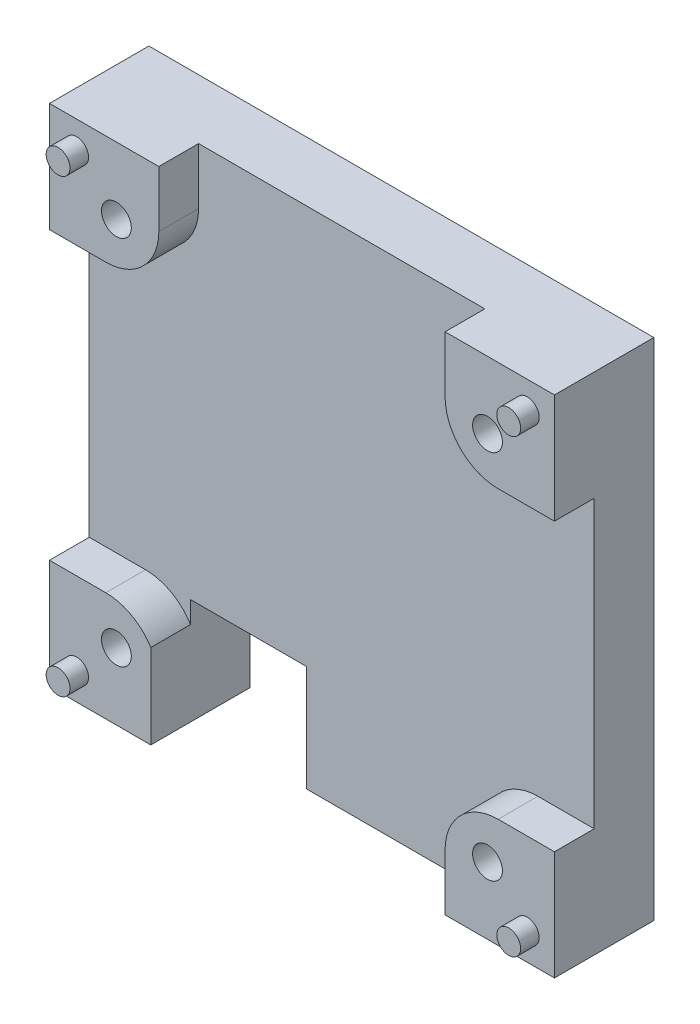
from build123d import *

# Parameters (mm, degrees)
SKETCH3_W           = 38.1
SKETCH3_H           = 38.1
SKETCH3_R           = 1.125
BOSS_EXTRUDE1_DEPTH = 4.5
BOSS_EXTRUDE2_START = 3
SKETCH2_R           = 1.125
BOSS_EXTRUDE2_DEPTH = 3
SKETCH4_W           = 8.75
SKETCH4_H           = 5.25
CUT_EXTRUDE1_DEPTH  = 10
SKETCH6_W           = 8.75
SKETCH6_H           = 2.75
CUT_EXTRUDE2_DEPTH  = 10
SKETCH7_R           = 0.9
BOSS_EXTRUDE3_DEPTH = 1.4


with BuildPart() as part:
    # Sketch3 → Boss-Extrude1 (new body)
    with BuildSketch(Plane.XY):
        with Locations((0.466348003, 11.564505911)):
            Rectangle(SKETCH3_W, SKETCH3_H)
        with Locations((-13.533651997, 25.564505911)):
            Circle(SKETCH3_R, mode=Mode.SUBTRACT)
        with Locations((14.466348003, 25.564505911)):
            Circle(SKETCH3_R, mode=Mode.SUBTRACT)
        with Locations((14.466348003, -2.435494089)):
            Circle(SKETCH3_R, mode=Mode.SUBTRACT)
        with Locations((-13.533651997, -2.435494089)):
            Circle(SKETCH3_R, mode=Mode.SUBTRACT)
    extrude(amount=-BOSS_EXTRUDE1_DEPTH)

    # Sketch2 → Boss-Extrude2 (add)
    # profile 1 of 4: a face of its own
    with BuildSketch(Plane.XY.offset(BOSS_EXTRUDE2_START)):
        with BuildLine():
            Line((-18.583651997, 30.614505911), (-10.333651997, 30.614505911))
            Line((-10.333651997, 30.614505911), (-10.333651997, 26.364505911))
            ThreePointArc((-10.333651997, 26.364505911), (-11.505224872, 23.536078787), (-14.333651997, 22.364505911))
            Line((-14.333651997, 22.364505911), (-18.583651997, 22.364505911))
            Line((-18.583651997, 22.364505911), (-18.583651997, 30.614505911))
        make_face()
        with Locations((-13.533651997, 25.564505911)):
            Circle(SKETCH2_R, mode=Mode.SUBTRACT)
    # profile 2 of 4: a face of its own
    with BuildSketch(Plane.XY.offset(BOSS_EXTRUDE2_START)):
        with BuildLine():
            Line((19.516348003, 30.614505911), (11.266348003, 30.614505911))
            Line((11.266348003, 30.614505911), (11.266348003, 26.364505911))
            ThreePointArc((11.266348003, 26.364505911), (12.437920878, 23.536078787), (15.266348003, 22.364505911))
            Line((15.266348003, 22.364505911), (19.516348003, 22.364505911))
            Line((19.516348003, 22.364505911), (19.516348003, 30.614505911))
        make_face()
        with Locations((14.466348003, 25.564505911)):
            Circle(SKETCH2_R, mode=Mode.SUBTRACT)
    # profile 3 of 4: a face of its own
    with BuildSketch(Plane.XY.offset(BOSS_EXTRUDE2_START)):
        with BuildLine():
            Line((19.516348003, -7.485494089), (11.266348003, -7.485494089))
            Line((11.266348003, -7.485494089), (11.266348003, -3.235494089))
            ThreePointArc((11.266348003, -3.235494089), (12.437920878, -0.407066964), (15.266348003, 0.764505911))
            Line((15.266348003, 0.764505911), (19.516348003, 0.764505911))
            Line((19.516348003, 0.764505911), (19.516348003, -7.485494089))
        make_face()
        with Locations((14.466348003, -2.435494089)):
            Circle(SKETCH2_R, mode=Mode.SUBTRACT)
    # profile 4 of 4: a face of its own
    with BuildSketch(Plane.XY.offset(BOSS_EXTRUDE2_START)):
        with BuildLine():
            Line((-18.583651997, -7.485494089), (-10.333651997, -7.485494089))
            Line((-10.333651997, -7.485494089), (-10.333651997, -3.235494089))
            ThreePointArc((-10.333651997, -3.235494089), (-11.505224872, -0.407066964), (-14.333651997, 0.764505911))
            Line((-14.333651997, 0.764505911), (-18.583651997, 0.764505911))
            Line((-18.583651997, 0.764505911), (-18.583651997, -7.485494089))
        make_face()
        with Locations((-13.533651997, -2.435494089)):
            Circle(SKETCH2_R, mode=Mode.SUBTRACT)
    extrude(amount=-BOSS_EXTRUDE2_DEPTH)

    # Sketch4 → Cut-Extrude1 (cut)
    with BuildSketch(Plane(origin=(0, 0, -4.5), x_dir=(-1, 0, 0), z_dir=(0, 0, -1))):
        with Locations((6.563651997, -2.110494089)):
            Rectangle(SKETCH4_W, SKETCH4_H)
    extrude(amount=-CUT_EXTRUDE1_DEPTH, mode=Mode.SUBTRACT)

    # Sketch6 → Cut-Extrude2 (cut)
    with BuildSketch(Plane(origin=(0, 0, -4.5), x_dir=(-1, 0, 0), z_dir=(0, 0, -1))):
        with Locations((6.563651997, -6.110494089)):
            Rectangle(SKETCH6_W, SKETCH6_H)
    extrude(amount=-CUT_EXTRUDE2_DEPTH, mode=Mode.SUBTRACT)

    # Sketch7 → Boss-Extrude3 (add)
    with BuildSketch(Plane.XY.offset(3)):
        with Locations((-16.533651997, 28.564505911)):
            Circle(SKETCH7_R)
        with Locations(Location((17.466348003, 28.564505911, 0), (0, 0, 180))):
            Circle(SKETCH7_R)
        with Locations((17.466348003, -5.435494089)):
            Circle(SKETCH7_R)
        with Locations(Location((-16.533651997, -5.435494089, 0), (0, 0, 180))):
            Circle(SKETCH7_R)
    extrude(amount=BOSS_EXTRUDE3_DEPTH)


solid = part.part
